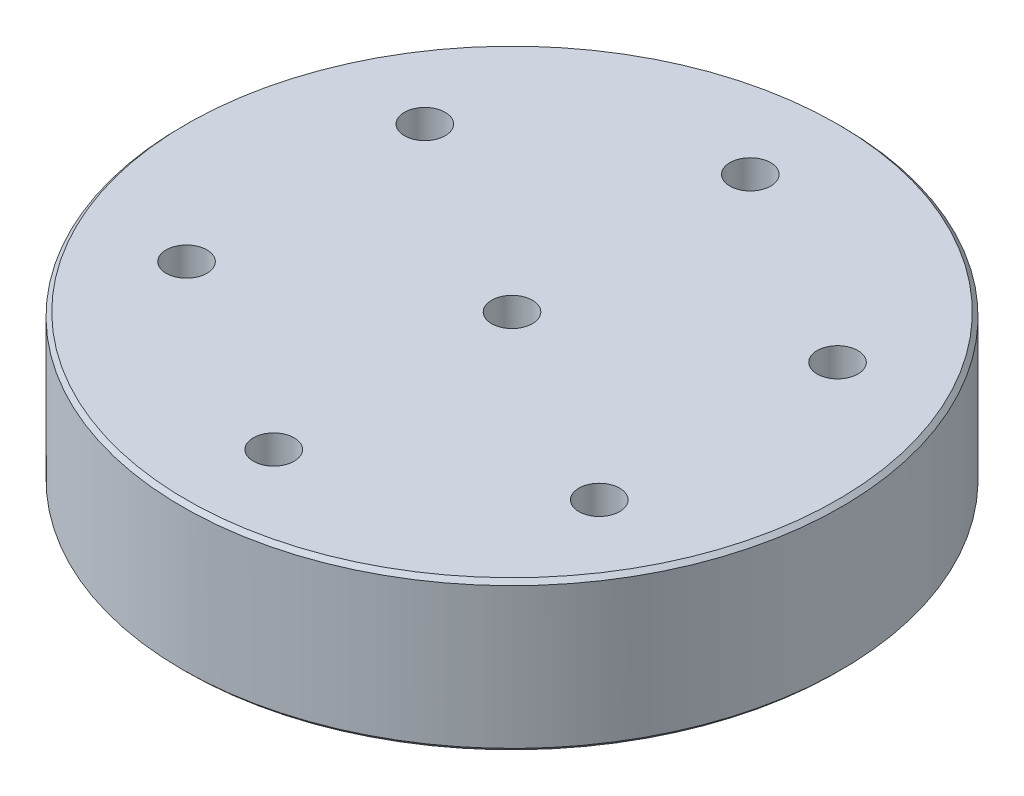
ISO-10303-21;
HEADER;
FILE_DESCRIPTION(('STEP AP214'),'2;1');
FILE_NAME('part.step','',(''),(''),'','','');
FILE_SCHEMA(('AUTOMOTIVE_DESIGN { 1 0 10303 214 1 1 1 1 }'));
ENDSEC;
DATA;
#1=APPLICATION_CONTEXT('core data for automotive mechanical design processes');
#2=APPLICATION_PROTOCOL_DEFINITION('international standard','automotive_design',2000,#1);
#3=PRODUCT_CONTEXT('',#1,'mechanical');
#4=PRODUCT('Part','Part','',(#3));
#5=PRODUCT_RELATED_PRODUCT_CATEGORY('part','',(#4));
#6=PRODUCT_DEFINITION_FORMATION('','',#4);
#7=PRODUCT_DEFINITION_CONTEXT('part definition',#1,'design');
#8=PRODUCT_DEFINITION('design','',#6,#7);
#9=PRODUCT_DEFINITION_SHAPE('','',#8);
#10=(LENGTH_UNIT() NAMED_UNIT(*) SI_UNIT(.MILLI.,.METRE.));
#11=(NAMED_UNIT(*) PLANE_ANGLE_UNIT() SI_UNIT($,.RADIAN.));
#12=(NAMED_UNIT(*) SI_UNIT($,.STERADIAN.) SOLID_ANGLE_UNIT());
#13=UNCERTAINTY_MEASURE_WITH_UNIT(LENGTH_MEASURE(1.E-05),#10,'distance_accuracy_value','');
#14=(GEOMETRIC_REPRESENTATION_CONTEXT(3) GLOBAL_UNCERTAINTY_ASSIGNED_CONTEXT((#13)) GLOBAL_UNIT_ASSIGNED_CONTEXT((#10,
#11,#12)) REPRESENTATION_CONTEXT('',''));
#15=CARTESIAN_POINT('',(0.,0.,0.));
#16=DIRECTION('',(0.,0.,1.));
#17=DIRECTION('',(1.,0.,0.));
#18=AXIS2_PLACEMENT_3D('',#15,#16,#17);
#19=CARTESIAN_POINT('',(0.,-8.82649999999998,0.));
#20=DIRECTION('',(0.,1.,0.));
#21=DIRECTION('',(0.,0.,1.));
#22=AXIS2_PLACEMENT_3D('',#19,#20,#21);
#23=CONICAL_SURFACE('',#22,41.275,0.785398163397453);
#24=CARTESIAN_POINT('',(0.,-9.3345,0.));
#25=DIRECTION('',(0.,1.,0.));
#26=DIRECTION('',(0.,0.,1.));
#27=AXIS2_PLACEMENT_3D('',#24,#25,#26);
#28=CIRCLE('',#27,40.767);
#29=CARTESIAN_POINT('',(0.,-9.3345,40.767));
#30=VERTEX_POINT('',#29);
#31=EDGE_CURVE('E17',#30,#30,#28,.T.);
#32=ORIENTED_EDGE('',*,*,#31,.T.);
#33=EDGE_LOOP('',(#32));
#34=FACE_BOUND('',#33,.T.);
#35=CARTESIAN_POINT('',(0.,-8.82649999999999,0.));
#36=DIRECTION('',(0.,-1.,0.));
#37=DIRECTION('',(0.,0.,-1.));
#38=AXIS2_PLACEMENT_3D('',#35,#36,#37);
#39=CIRCLE('',#38,41.275);
#40=CARTESIAN_POINT('',(0.,-8.82649999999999,-41.275));
#41=VERTEX_POINT('',#40);
#42=EDGE_CURVE('E29',#41,#41,#39,.F.);
#43=ORIENTED_EDGE('',*,*,#42,.F.);
#44=EDGE_LOOP('',(#43));
#45=FACE_BOUND('',#44,.T.);
#46=ADVANCED_FACE('F14',(#34,#45),#23,.T.);
#47=CARTESIAN_POINT('',(0.,9.3345,0.));
#48=DIRECTION('',(0.,-1.,0.));
#49=DIRECTION('',(0.,0.,-1.));
#50=AXIS2_PLACEMENT_3D('',#47,#48,#49);
#51=CYLINDRICAL_SURFACE('',#50,41.275);
#52=ORIENTED_EDGE('',*,*,#42,.T.);
#53=EDGE_LOOP('',(#52));
#54=FACE_BOUND('',#53,.T.);
#55=CARTESIAN_POINT('',(0.,8.82650000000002,0.));
#56=DIRECTION('',(0.,-1.,0.));
#57=DIRECTION('',(0.,0.,-1.));
#58=AXIS2_PLACEMENT_3D('',#55,#56,#57);
#59=CIRCLE('',#58,41.275);
#60=CARTESIAN_POINT('',(0.,8.82650000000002,-41.275));
#61=VERTEX_POINT('',#60);
#62=EDGE_CURVE('E68',#61,#61,#59,.F.);
#63=ORIENTED_EDGE('',*,*,#62,.F.);
#64=EDGE_LOOP('',(#63));
#65=FACE_BOUND('',#64,.T.);
#66=ADVANCED_FACE('F80',(#54,#65),#51,.T.);
#67=CARTESIAN_POINT('',(0.,-9.3345,0.));
#68=DIRECTION('',(0.,1.,0.));
#69=DIRECTION('',(0.,0.,1.));
#70=AXIS2_PLACEMENT_3D('',#67,#68,#69);
#71=PLANE('',#70);
#72=CARTESIAN_POINT('',(0.,-9.3345,29.845));
#73=DIRECTION('',(0.,1.,0.));
#74=DIRECTION('',(0.,0.,1.));
#75=AXIS2_PLACEMENT_3D('',#72,#73,#74);
#76=CIRCLE('',#75,2.55269999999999);
#77=CARTESIAN_POINT('',(0.,-9.3345,32.3977));
#78=VERTEX_POINT('',#77);
#79=EDGE_CURVE('E49',#78,#78,#76,.T.);
#80=ORIENTED_EDGE('',*,*,#79,.T.);
#81=EDGE_LOOP('',(#80));
#82=FACE_BOUND('',#81,.T.);
#83=CARTESIAN_POINT('',(25.8465281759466,-9.3345,14.9224999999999));
#84=DIRECTION('',(0.,1.,0.));
#85=DIRECTION('',(0.,0.,1.));
#86=AXIS2_PLACEMENT_3D('',#83,#84,#85);
#87=CIRCLE('',#86,2.55269999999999);
#88=CARTESIAN_POINT('',(25.8465281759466,-9.3345,17.4751999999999));
#89=VERTEX_POINT('',#88);
#90=EDGE_CURVE('E52',#89,#89,#87,.T.);
#91=ORIENTED_EDGE('',*,*,#90,.T.);
#92=EDGE_LOOP('',(#91));
#93=FACE_BOUND('',#92,.T.);
#94=CARTESIAN_POINT('',(-25.8465281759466,-9.3345,-14.9224999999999));
#95=DIRECTION('',(0.,1.,0.));
#96=DIRECTION('',(0.,0.,1.));
#97=AXIS2_PLACEMENT_3D('',#94,#95,#96);
#98=CIRCLE('',#97,2.55269999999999);
#99=CARTESIAN_POINT('',(-25.8465281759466,-9.3345,-12.3697999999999));
#100=VERTEX_POINT('',#99);
#101=EDGE_CURVE('E55',#100,#100,#98,.T.);
#102=ORIENTED_EDGE('',*,*,#101,.T.);
#103=EDGE_LOOP('',(#102));
#104=FACE_BOUND('',#103,.T.);
#105=CARTESIAN_POINT('',(0.,-9.3345,-29.845));
#106=DIRECTION('',(0.,1.,0.));
#107=DIRECTION('',(0.,0.,1.));
#108=AXIS2_PLACEMENT_3D('',#105,#106,#107);
#109=CIRCLE('',#108,2.55269999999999);
#110=CARTESIAN_POINT('',(0.,-9.3345,-27.2923));
#111=VERTEX_POINT('',#110);
#112=EDGE_CURVE('E58',#111,#111,#109,.T.);
#113=ORIENTED_EDGE('',*,*,#112,.T.);
#114=EDGE_LOOP('',(#113));
#115=FACE_BOUND('',#114,.T.);
#116=CARTESIAN_POINT('',(25.8465281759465,-9.3345,-14.9225000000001));
#117=DIRECTION('',(0.,1.,0.));
#118=DIRECTION('',(0.,0.,1.));
#119=AXIS2_PLACEMENT_3D('',#116,#117,#118);
#120=CIRCLE('',#119,2.55269999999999);
#121=CARTESIAN_POINT('',(25.8465281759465,-9.3345,-12.3698000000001));
#122=VERTEX_POINT('',#121);
#123=EDGE_CURVE('E61',#122,#122,#120,.T.);
#124=ORIENTED_EDGE('',*,*,#123,.T.);
#125=EDGE_LOOP('',(#124));
#126=FACE_BOUND('',#125,.T.);
#127=CARTESIAN_POINT('',(-25.8465281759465,-9.3345,14.9225000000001));
#128=DIRECTION('',(0.,1.,0.));
#129=DIRECTION('',(0.,0.,1.));
#130=AXIS2_PLACEMENT_3D('',#127,#128,#129);
#131=CIRCLE('',#130,2.55269999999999);
#132=CARTESIAN_POINT('',(-25.8465281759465,-9.3345,17.4752000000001));
#133=VERTEX_POINT('',#132);
#134=EDGE_CURVE('E64',#133,#133,#131,.T.);
#135=ORIENTED_EDGE('',*,*,#134,.T.);
#136=EDGE_LOOP('',(#135));
#137=FACE_BOUND('',#136,.T.);
#138=CARTESIAN_POINT('',(0.,-9.3345,0.));
#139=DIRECTION('',(0.,1.,0.));
#140=DIRECTION('',(0.,0.,1.));
#141=AXIS2_PLACEMENT_3D('',#138,#139,#140);
#142=CIRCLE('',#141,2.55269999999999);
#143=CARTESIAN_POINT('',(0.,-9.3345,2.55269999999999));
#144=VERTEX_POINT('',#143);
#145=EDGE_CURVE('E66',#144,#144,#142,.T.);
#146=ORIENTED_EDGE('',*,*,#145,.T.);
#147=EDGE_LOOP('',(#146));
#148=FACE_BOUND('',#147,.T.);
#149=ORIENTED_EDGE('',*,*,#31,.F.);
#150=EDGE_LOOP('',(#149));
#151=FACE_BOUND('',#150,.T.);
#152=ADVANCED_FACE('F88',(#82,#93,#104,#115,#126,#137,#148,#151),#71,.F.);
#153=CARTESIAN_POINT('',(0.,8.82650000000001,0.));
#154=DIRECTION('',(0.,-1.,0.));
#155=DIRECTION('',(0.,0.,-1.));
#156=AXIS2_PLACEMENT_3D('',#153,#154,#155);
#157=CONICAL_SURFACE('',#156,41.275,0.785398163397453);
#158=ORIENTED_EDGE('',*,*,#62,.T.);
#159=EDGE_LOOP('',(#158));
#160=FACE_BOUND('',#159,.T.);
#161=CARTESIAN_POINT('',(0.,9.33449999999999,0.));
#162=DIRECTION('',(0.,-1.,0.));
#163=DIRECTION('',(0.,0.,-1.));
#164=AXIS2_PLACEMENT_3D('',#161,#162,#163);
#165=CIRCLE('',#164,40.767);
#166=CARTESIAN_POINT('',(0.,9.33449999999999,-40.767));
#167=VERTEX_POINT('',#166);
#168=EDGE_CURVE('E46',#167,#167,#165,.F.);
#169=ORIENTED_EDGE('',*,*,#168,.F.);
#170=EDGE_LOOP('',(#169));
#171=FACE_BOUND('',#170,.T.);
#172=ADVANCED_FACE('F123',(#160,#171),#157,.T.);
#173=CARTESIAN_POINT('',(0.,9.3345,0.));
#174=DIRECTION('',(0.,1.,0.));
#175=DIRECTION('',(0.,0.,1.));
#176=AXIS2_PLACEMENT_3D('',#173,#174,#175);
#177=CYLINDRICAL_SURFACE('',#176,2.55269999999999);
#178=CARTESIAN_POINT('',(0.,9.3345,0.));
#179=DIRECTION('',(0.,1.,0.));
#180=DIRECTION('',(0.,0.,1.));
#181=AXIS2_PLACEMENT_3D('',#178,#179,#180);
#182=CIRCLE('',#181,2.55269999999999);
#183=CARTESIAN_POINT('',(0.,9.3345,2.55269999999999));
#184=VERTEX_POINT('',#183);
#185=EDGE_CURVE('E43',#184,#184,#182,.F.);
#186=ORIENTED_EDGE('',*,*,#185,.F.);
#187=EDGE_LOOP('',(#186));
#188=FACE_BOUND('',#187,.T.);
#189=ORIENTED_EDGE('',*,*,#145,.F.);
#190=EDGE_LOOP('',(#189));
#191=FACE_BOUND('',#190,.T.);
#192=ADVANCED_FACE('F119',(#188,#191),#177,.F.);
#193=CARTESIAN_POINT('',(-25.8465281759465,9.3345,14.9225000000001));
#194=DIRECTION('',(0.,1.,0.));
#195=DIRECTION('',(0.,0.,1.));
#196=AXIS2_PLACEMENT_3D('',#193,#194,#195);
#197=CYLINDRICAL_SURFACE('',#196,2.55269999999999);
#198=CARTESIAN_POINT('',(-25.8465281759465,9.3345,14.9225000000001));
#199=DIRECTION('',(0.,1.,0.));
#200=DIRECTION('',(0.,0.,1.));
#201=AXIS2_PLACEMENT_3D('',#198,#199,#200);
#202=CIRCLE('',#201,2.55269999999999);
#203=CARTESIAN_POINT('',(-25.8465281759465,9.3345,17.4752000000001));
#204=VERTEX_POINT('',#203);
#205=EDGE_CURVE('E40',#204,#204,#202,.F.);
#206=ORIENTED_EDGE('',*,*,#205,.F.);
#207=EDGE_LOOP('',(#206));
#208=FACE_BOUND('',#207,.T.);
#209=ORIENTED_EDGE('',*,*,#134,.F.);
#210=EDGE_LOOP('',(#209));
#211=FACE_BOUND('',#210,.T.);
#212=ADVANCED_FACE('F115',(#208,#211),#197,.F.);
#213=CARTESIAN_POINT('',(25.8465281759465,9.3345,-14.9225000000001));
#214=DIRECTION('',(0.,1.,0.));
#215=DIRECTION('',(0.,0.,1.));
#216=AXIS2_PLACEMENT_3D('',#213,#214,#215);
#217=CYLINDRICAL_SURFACE('',#216,2.55269999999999);
#218=CARTESIAN_POINT('',(25.8465281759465,9.3345,-14.9225000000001));
#219=DIRECTION('',(0.,1.,0.));
#220=DIRECTION('',(0.,0.,1.));
#221=AXIS2_PLACEMENT_3D('',#218,#219,#220);
#222=CIRCLE('',#221,2.55269999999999);
#223=CARTESIAN_POINT('',(25.8465281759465,9.3345,-12.3698000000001));
#224=VERTEX_POINT('',#223);
#225=EDGE_CURVE('E37',#224,#224,#222,.F.);
#226=ORIENTED_EDGE('',*,*,#225,.F.);
#227=EDGE_LOOP('',(#226));
#228=FACE_BOUND('',#227,.T.);
#229=ORIENTED_EDGE('',*,*,#123,.F.);
#230=EDGE_LOOP('',(#229));
#231=FACE_BOUND('',#230,.T.);
#232=ADVANCED_FACE('F111',(#228,#231),#217,.F.);
#233=CARTESIAN_POINT('',(0.,9.3345,-29.845));
#234=DIRECTION('',(0.,1.,0.));
#235=DIRECTION('',(0.,0.,1.));
#236=AXIS2_PLACEMENT_3D('',#233,#234,#235);
#237=CYLINDRICAL_SURFACE('',#236,2.55269999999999);
#238=CARTESIAN_POINT('',(0.,9.3345,-29.845));
#239=DIRECTION('',(0.,1.,0.));
#240=DIRECTION('',(0.,0.,1.));
#241=AXIS2_PLACEMENT_3D('',#238,#239,#240);
#242=CIRCLE('',#241,2.55269999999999);
#243=CARTESIAN_POINT('',(0.,9.3345,-27.2923));
#244=VERTEX_POINT('',#243);
#245=EDGE_CURVE('E34',#244,#244,#242,.F.);
#246=ORIENTED_EDGE('',*,*,#245,.F.);
#247=EDGE_LOOP('',(#246));
#248=FACE_BOUND('',#247,.T.);
#249=ORIENTED_EDGE('',*,*,#112,.F.);
#250=EDGE_LOOP('',(#249));
#251=FACE_BOUND('',#250,.T.);
#252=ADVANCED_FACE('F107',(#248,#251),#237,.F.);
#253=CARTESIAN_POINT('',(-25.8465281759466,9.3345,-14.9224999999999));
#254=DIRECTION('',(0.,1.,0.));
#255=DIRECTION('',(0.,0.,1.));
#256=AXIS2_PLACEMENT_3D('',#253,#254,#255);
#257=CYLINDRICAL_SURFACE('',#256,2.55269999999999);
#258=CARTESIAN_POINT('',(-25.8465281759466,9.3345,-14.9224999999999));
#259=DIRECTION('',(0.,1.,0.));
#260=DIRECTION('',(0.,0.,1.));
#261=AXIS2_PLACEMENT_3D('',#258,#259,#260);
#262=CIRCLE('',#261,2.55269999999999);
#263=CARTESIAN_POINT('',(-25.8465281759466,9.3345,-12.3697999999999));
#264=VERTEX_POINT('',#263);
#265=EDGE_CURVE('E26',#264,#264,#262,.F.);
#266=ORIENTED_EDGE('',*,*,#265,.F.);
#267=EDGE_LOOP('',(#266));
#268=FACE_BOUND('',#267,.T.);
#269=ORIENTED_EDGE('',*,*,#101,.F.);
#270=EDGE_LOOP('',(#269));
#271=FACE_BOUND('',#270,.T.);
#272=ADVANCED_FACE('F103',(#268,#271),#257,.F.);
#273=CARTESIAN_POINT('',(25.8465281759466,9.3345,14.9224999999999));
#274=DIRECTION('',(0.,1.,0.));
#275=DIRECTION('',(0.,0.,1.));
#276=AXIS2_PLACEMENT_3D('',#273,#274,#275);
#277=CYLINDRICAL_SURFACE('',#276,2.55269999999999);
#278=CARTESIAN_POINT('',(25.8465281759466,9.3345,14.9224999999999));
#279=DIRECTION('',(0.,1.,0.));
#280=DIRECTION('',(0.,0.,1.));
#281=AXIS2_PLACEMENT_3D('',#278,#279,#280);
#282=CIRCLE('',#281,2.55269999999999);
#283=CARTESIAN_POINT('',(25.8465281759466,9.3345,17.4751999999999));
#284=VERTEX_POINT('',#283);
#285=EDGE_CURVE('E21',#284,#284,#282,.F.);
#286=ORIENTED_EDGE('',*,*,#285,.F.);
#287=EDGE_LOOP('',(#286));
#288=FACE_BOUND('',#287,.T.);
#289=ORIENTED_EDGE('',*,*,#90,.F.);
#290=EDGE_LOOP('',(#289));
#291=FACE_BOUND('',#290,.T.);
#292=ADVANCED_FACE('F96',(#288,#291),#277,.F.);
#293=CARTESIAN_POINT('',(0.,9.3345,29.845));
#294=DIRECTION('',(0.,1.,0.));
#295=DIRECTION('',(0.,0.,1.));
#296=AXIS2_PLACEMENT_3D('',#293,#294,#295);
#297=CYLINDRICAL_SURFACE('',#296,2.55269999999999);
#298=CARTESIAN_POINT('',(0.,9.3345,29.845));
#299=DIRECTION('',(0.,1.,0.));
#300=DIRECTION('',(0.,0.,1.));
#301=AXIS2_PLACEMENT_3D('',#298,#299,#300);
#302=CIRCLE('',#301,2.55269999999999);
#303=CARTESIAN_POINT('',(0.,9.3345,32.3977));
#304=VERTEX_POINT('',#303);
#305=EDGE_CURVE('E10',#304,#304,#302,.F.);
#306=ORIENTED_EDGE('',*,*,#305,.F.);
#307=EDGE_LOOP('',(#306));
#308=FACE_BOUND('',#307,.T.);
#309=ORIENTED_EDGE('',*,*,#79,.F.);
#310=EDGE_LOOP('',(#309));
#311=FACE_BOUND('',#310,.T.);
#312=ADVANCED_FACE('F91',(#308,#311),#297,.F.);
#313=CARTESIAN_POINT('',(0.,9.3345,0.));
#314=DIRECTION('',(0.,1.,0.));
#315=DIRECTION('',(0.,0.,1.));
#316=AXIS2_PLACEMENT_3D('',#313,#314,#315);
#317=PLANE('',#316);
#318=ORIENTED_EDGE('',*,*,#305,.T.);
#319=EDGE_LOOP('',(#318));
#320=FACE_BOUND('',#319,.T.);
#321=ORIENTED_EDGE('',*,*,#285,.T.);
#322=EDGE_LOOP('',(#321));
#323=FACE_BOUND('',#322,.T.);
#324=ORIENTED_EDGE('',*,*,#265,.T.);
#325=EDGE_LOOP('',(#324));
#326=FACE_BOUND('',#325,.T.);
#327=ORIENTED_EDGE('',*,*,#245,.T.);
#328=EDGE_LOOP('',(#327));
#329=FACE_BOUND('',#328,.T.);
#330=ORIENTED_EDGE('',*,*,#225,.T.);
#331=EDGE_LOOP('',(#330));
#332=FACE_BOUND('',#331,.T.);
#333=ORIENTED_EDGE('',*,*,#205,.T.);
#334=EDGE_LOOP('',(#333));
#335=FACE_BOUND('',#334,.T.);
#336=ORIENTED_EDGE('',*,*,#185,.T.);
#337=EDGE_LOOP('',(#336));
#338=FACE_BOUND('',#337,.T.);
#339=ORIENTED_EDGE('',*,*,#168,.T.);
#340=EDGE_LOOP('',(#339));
#341=FACE_BOUND('',#340,.T.);
#342=ADVANCED_FACE('F89',(#320,#323,#326,#329,#332,#335,#338,#341),#317,.T.);
#343=CLOSED_SHELL('',(#46,#66,#152,#172,#192,#212,#232,#252,#272,#292,#312,#342));
#344=MANIFOLD_SOLID_BREP('B1',#343);
#345=ADVANCED_BREP_SHAPE_REPRESENTATION('',(#18,#344),#14);
#346=SHAPE_DEFINITION_REPRESENTATION(#9,#345);
ENDSEC;
END-ISO-10303-21;
